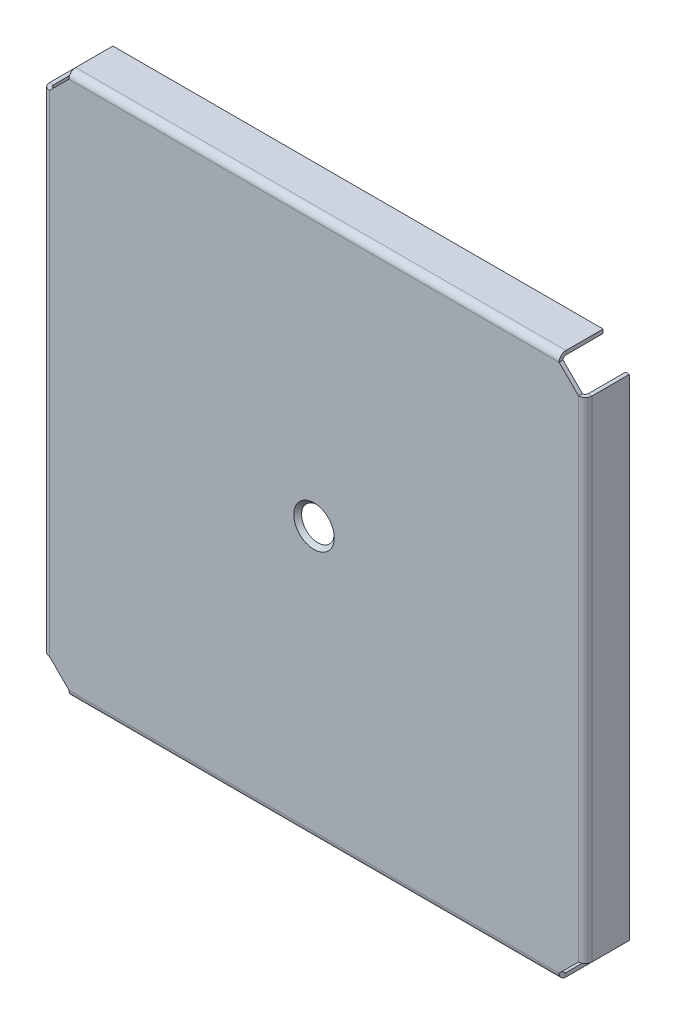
ISO-10303-21;
HEADER;
FILE_DESCRIPTION(('STEP AP214'),'2;1');
FILE_NAME('part.step','',(''),(''),'','','');
FILE_SCHEMA(('AUTOMOTIVE_DESIGN { 1 0 10303 214 1 1 1 1 }'));
ENDSEC;
DATA;
#1=APPLICATION_CONTEXT('core data for automotive mechanical design processes');
#2=APPLICATION_PROTOCOL_DEFINITION('international standard','automotive_design',2000,#1);
#3=PRODUCT_CONTEXT('',#1,'mechanical');
#4=PRODUCT('Part','Part','',(#3));
#5=PRODUCT_RELATED_PRODUCT_CATEGORY('part','',(#4));
#6=PRODUCT_DEFINITION_FORMATION('','',#4);
#7=PRODUCT_DEFINITION_CONTEXT('part definition',#1,'design');
#8=PRODUCT_DEFINITION('design','',#6,#7);
#9=PRODUCT_DEFINITION_SHAPE('','',#8);
#10=(LENGTH_UNIT() NAMED_UNIT(*) SI_UNIT(.MILLI.,.METRE.));
#11=(NAMED_UNIT(*) PLANE_ANGLE_UNIT() SI_UNIT($,.RADIAN.));
#12=(NAMED_UNIT(*) SI_UNIT($,.STERADIAN.) SOLID_ANGLE_UNIT());
#13=UNCERTAINTY_MEASURE_WITH_UNIT(LENGTH_MEASURE(1.E-05),#10,'distance_accuracy_value','');
#14=(GEOMETRIC_REPRESENTATION_CONTEXT(3) GLOBAL_UNCERTAINTY_ASSIGNED_CONTEXT((#13)) GLOBAL_UNIT_ASSIGNED_CONTEXT((#10,
#11,#12)) REPRESENTATION_CONTEXT('',''));
#15=CARTESIAN_POINT('',(0.,0.,0.));
#16=DIRECTION('',(0.,0.,1.));
#17=DIRECTION('',(1.,0.,0.));
#18=AXIS2_PLACEMENT_3D('',#15,#16,#17);
#19=CARTESIAN_POINT('',(-57.5362417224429,104.877514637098,-1.));
#20=DIRECTION('',(-0.707106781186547,0.707106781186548,0.));
#21=DIRECTION('',(-0.707106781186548,-0.707106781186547,0.));
#22=AXIS2_PLACEMENT_3D('',#19,#20,#21);
#23=PLANE('',#22);
#24=DIRECTION('',(-0.707106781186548,-0.707106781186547,0.));
#25=VECTOR('',#24,1.);
#26=CARTESIAN_POINT('',(-57.5362417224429,104.877514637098,0.));
#27=LINE('',#26,#25);
#28=CARTESIAN_POINT('',(-57.5362417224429,104.877514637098,0.));
#29=VERTEX_POINT('',#28);
#30=CARTESIAN_POINT('',(-62.5362417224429,99.8775146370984,0.));
#31=VERTEX_POINT('',#30);
#32=EDGE_CURVE('E515',#29,#31,#27,.T.);
#33=ORIENTED_EDGE('',*,*,#32,.F.);
#34=DIRECTION('',(0.,0.,1.));
#35=VECTOR('',#34,1.);
#36=CARTESIAN_POINT('',(-57.5362417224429,104.877514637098,-1.));
#37=LINE('',#36,#35);
#38=CARTESIAN_POINT('',(-57.5362417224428,104.877514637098,-1.));
#39=VERTEX_POINT('',#38);
#40=EDGE_CURVE('E133',#39,#29,#37,.T.);
#41=ORIENTED_EDGE('',*,*,#40,.F.);
#42=DIRECTION('',(-0.707106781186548,-0.707106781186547,0.));
#43=VECTOR('',#42,1.);
#44=CARTESIAN_POINT('',(-57.5362417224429,104.877514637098,-1.));
#45=LINE('',#44,#43);
#46=CARTESIAN_POINT('',(-62.5362417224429,99.8775146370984,-1.));
#47=VERTEX_POINT('',#46);
#48=EDGE_CURVE('E527',#39,#47,#45,.T.);
#49=ORIENTED_EDGE('',*,*,#48,.T.);
#50=DIRECTION('',(0.,0.,1.));
#51=VECTOR('',#50,1.);
#52=CARTESIAN_POINT('',(-62.5362417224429,99.8775146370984,-1.));
#53=LINE('',#52,#51);
#54=EDGE_CURVE('E556',#47,#31,#53,.T.);
#55=ORIENTED_EDGE('',*,*,#54,.T.);
#56=EDGE_LOOP('',(#33,#41,#49,#55));
#57=FACE_BOUND('',#56,.T.);
#58=ADVANCED_FACE('F123',(#57),#23,.T.);
#59=CARTESIAN_POINT('',(73.4637582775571,99.8775146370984,-1.));
#60=DIRECTION('',(0.707106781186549,0.707106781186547,0.));
#61=DIRECTION('',(-0.707106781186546,0.707106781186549,0.));
#62=AXIS2_PLACEMENT_3D('',#59,#60,#61);
#63=PLANE('',#62);
#64=DIRECTION('',(-0.707106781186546,0.707106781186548,0.));
#65=VECTOR('',#64,1.);
#66=CARTESIAN_POINT('',(73.4637582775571,99.8775146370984,0.));
#67=LINE('',#66,#65);
#68=CARTESIAN_POINT('',(73.4637582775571,99.8775146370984,0.));
#69=VERTEX_POINT('',#68);
#70=CARTESIAN_POINT('',(68.4637582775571,104.877514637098,0.));
#71=VERTEX_POINT('',#70);
#72=EDGE_CURVE('E580',#69,#71,#67,.T.);
#73=ORIENTED_EDGE('',*,*,#72,.F.);
#74=DIRECTION('',(0.,0.,1.));
#75=VECTOR('',#74,1.);
#76=CARTESIAN_POINT('',(73.4637582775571,99.8775146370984,-1.));
#77=LINE('',#76,#75);
#78=CARTESIAN_POINT('',(73.4637582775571,99.8775146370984,-0.99999999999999));
#79=VERTEX_POINT('',#78);
#80=EDGE_CURVE('E593',#79,#69,#77,.T.);
#81=ORIENTED_EDGE('',*,*,#80,.F.);
#82=DIRECTION('',(-0.707106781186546,0.707106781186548,0.));
#83=VECTOR('',#82,1.);
#84=CARTESIAN_POINT('',(73.4637582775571,99.8775146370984,-1.));
#85=LINE('',#84,#83);
#86=CARTESIAN_POINT('',(68.4637582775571,104.877514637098,-1.));
#87=VERTEX_POINT('',#86);
#88=EDGE_CURVE('E549',#79,#87,#85,.T.);
#89=ORIENTED_EDGE('',*,*,#88,.T.);
#90=DIRECTION('',(0.,0.,1.));
#91=VECTOR('',#90,1.);
#92=CARTESIAN_POINT('',(68.4637582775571,104.877514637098,-1.));
#93=LINE('',#92,#91);
#94=EDGE_CURVE('E589',#87,#71,#93,.T.);
#95=ORIENTED_EDGE('',*,*,#94,.T.);
#96=EDGE_LOOP('',(#73,#81,#89,#95));
#97=FACE_BOUND('',#96,.T.);
#98=ADVANCED_FACE('F629',(#97),#63,.T.);
#99=CARTESIAN_POINT('',(68.4637582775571,-31.1224853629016,-1.));
#100=DIRECTION('',(0.707106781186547,-0.707106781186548,0.));
#101=DIRECTION('',(0.707106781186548,0.707106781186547,0.));
#102=AXIS2_PLACEMENT_3D('',#99,#100,#101);
#103=PLANE('',#102);
#104=DIRECTION('',(0.707106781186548,0.707106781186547,0.));
#105=VECTOR('',#104,1.);
#106=CARTESIAN_POINT('',(68.4637582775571,-31.1224853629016,0.));
#107=LINE('',#106,#105);
#108=CARTESIAN_POINT('',(68.4637582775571,-31.1224853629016,0.));
#109=VERTEX_POINT('',#108);
#110=CARTESIAN_POINT('',(73.4637582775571,-26.1224853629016,0.));
#111=VERTEX_POINT('',#110);
#112=EDGE_CURVE('E572',#109,#111,#107,.T.);
#113=ORIENTED_EDGE('',*,*,#112,.F.);
#114=DIRECTION('',(0.,0.,1.));
#115=VECTOR('',#114,1.);
#116=CARTESIAN_POINT('',(68.4637582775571,-31.1224853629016,-1.));
#117=LINE('',#116,#115);
#118=CARTESIAN_POINT('',(68.4637582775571,-31.1224853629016,-1.00000000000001));
#119=VERTEX_POINT('',#118);
#120=EDGE_CURVE('E600',#119,#109,#117,.T.);
#121=ORIENTED_EDGE('',*,*,#120,.F.);
#122=DIRECTION('',(0.707106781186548,0.707106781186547,0.));
#123=VECTOR('',#122,1.);
#124=CARTESIAN_POINT('',(68.4637582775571,-31.1224853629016,-1.));
#125=LINE('',#124,#123);
#126=CARTESIAN_POINT('',(73.4637582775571,-26.1224853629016,-0.99999999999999));
#127=VERTEX_POINT('',#126);
#128=EDGE_CURVE('E542',#119,#127,#125,.T.);
#129=ORIENTED_EDGE('',*,*,#128,.T.);
#130=DIRECTION('',(0.,0.,1.));
#131=VECTOR('',#130,1.);
#132=CARTESIAN_POINT('',(73.4637582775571,-26.1224853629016,-1.));
#133=LINE('',#132,#131);
#134=EDGE_CURVE('E596',#127,#111,#133,.T.);
#135=ORIENTED_EDGE('',*,*,#134,.T.);
#136=EDGE_LOOP('',(#113,#121,#129,#135));
#137=FACE_BOUND('',#136,.T.);
#138=ADVANCED_FACE('F675',(#137),#103,.T.);
#139=CARTESIAN_POINT('',(-62.5362417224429,-26.1224853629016,-1.));
#140=DIRECTION('',(-0.707106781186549,-0.707106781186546,0.));
#141=DIRECTION('',(0.707106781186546,-0.707106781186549,0.));
#142=AXIS2_PLACEMENT_3D('',#139,#140,#141);
#143=PLANE('',#142);
#144=DIRECTION('',(0.707106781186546,-0.707106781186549,0.));
#145=VECTOR('',#144,1.);
#146=CARTESIAN_POINT('',(-62.5362417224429,-26.1224853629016,0.));
#147=LINE('',#146,#145);
#148=CARTESIAN_POINT('',(-62.5362417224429,-26.1224853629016,0.));
#149=VERTEX_POINT('',#148);
#150=CARTESIAN_POINT('',(-57.5362417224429,-31.1224853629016,0.));
#151=VERTEX_POINT('',#150);
#152=EDGE_CURVE('E564',#149,#151,#147,.T.);
#153=ORIENTED_EDGE('',*,*,#152,.F.);
#154=DIRECTION('',(0.,0.,1.));
#155=VECTOR('',#154,1.);
#156=CARTESIAN_POINT('',(-62.5362417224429,-26.1224853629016,-1.));
#157=LINE('',#156,#155);
#158=CARTESIAN_POINT('',(-62.5362417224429,-26.1224853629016,-1.));
#159=VERTEX_POINT('',#158);
#160=EDGE_CURVE('E608',#159,#149,#157,.T.);
#161=ORIENTED_EDGE('',*,*,#160,.F.);
#162=DIRECTION('',(0.707106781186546,-0.707106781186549,0.));
#163=VECTOR('',#162,1.);
#164=CARTESIAN_POINT('',(-62.5362417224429,-26.1224853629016,-1.));
#165=LINE('',#164,#163);
#166=CARTESIAN_POINT('',(-57.5362417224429,-31.1224853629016,-0.999999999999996));
#167=VERTEX_POINT('',#166);
#168=EDGE_CURVE('E535',#159,#167,#165,.T.);
#169=ORIENTED_EDGE('',*,*,#168,.T.);
#170=DIRECTION('',(0.,0.,1.));
#171=VECTOR('',#170,1.);
#172=CARTESIAN_POINT('',(-57.5362417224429,-31.1224853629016,-1.));
#173=LINE('',#172,#171);
#174=EDGE_CURVE('E604',#167,#151,#173,.T.);
#175=ORIENTED_EDGE('',*,*,#174,.T.);
#176=EDGE_LOOP('',(#153,#161,#169,#175));
#177=FACE_BOUND('',#176,.T.);
#178=ADVANCED_FACE('F678',(#177),#143,.T.);
#179=CARTESIAN_POINT('',(0.,0.,-1.));
#180=DIRECTION('',(0.,0.,1.));
#181=DIRECTION('',(1.,0.,0.));
#182=AXIS2_PLACEMENT_3D('',#179,#180,#181);
#183=PLANE('',#182);
#184=CARTESIAN_POINT('',(5.46375827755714,36.8775146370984,-1.));
#185=DIRECTION('',(0.,0.,-1.));
#186=DIRECTION('',(-1.,0.,0.));
#187=AXIS2_PLACEMENT_3D('',#184,#185,#186);
#188=CIRCLE('',#187,4.2);
#189=CARTESIAN_POINT('',(1.26375827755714,36.8775146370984,-1.));
#190=VERTEX_POINT('',#189);
#191=EDGE_CURVE('E339',#190,#190,#188,.T.);
#192=ORIENTED_EDGE('',*,*,#191,.F.);
#193=EDGE_LOOP('',(#192));
#194=FACE_BOUND('',#193,.T.);
#195=ORIENTED_EDGE('',*,*,#48,.F.);
#196=DIRECTION('',(-1.,0.,0.));
#197=VECTOR('',#196,1.);
#198=CARTESIAN_POINT('',(68.4637582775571,104.877514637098,-1.));
#199=LINE('',#198,#197);
#200=EDGE_CURVE('E553',#87,#39,#199,.T.);
#201=ORIENTED_EDGE('',*,*,#200,.F.);
#202=ORIENTED_EDGE('',*,*,#88,.F.);
#203=DIRECTION('',(0.,1.,0.));
#204=VECTOR('',#203,1.);
#205=CARTESIAN_POINT('',(73.4637582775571,-26.1224853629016,-1.));
#206=LINE('',#205,#204);
#207=EDGE_CURVE('E546',#127,#79,#206,.T.);
#208=ORIENTED_EDGE('',*,*,#207,.F.);
#209=ORIENTED_EDGE('',*,*,#128,.F.);
#210=DIRECTION('',(1.,0.,0.));
#211=VECTOR('',#210,1.);
#212=CARTESIAN_POINT('',(-57.5362417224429,-31.1224853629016,-1.));
#213=LINE('',#212,#211);
#214=EDGE_CURVE('E539',#167,#119,#213,.T.);
#215=ORIENTED_EDGE('',*,*,#214,.F.);
#216=ORIENTED_EDGE('',*,*,#168,.F.);
#217=DIRECTION('',(0.,-1.,0.));
#218=VECTOR('',#217,1.);
#219=CARTESIAN_POINT('',(-62.5362417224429,99.8775146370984,-1.));
#220=LINE('',#219,#218);
#221=EDGE_CURVE('E531',#47,#159,#220,.T.);
#222=ORIENTED_EDGE('',*,*,#221,.F.);
#223=EDGE_LOOP('',(#195,#201,#202,#208,#209,#215,#216,#222));
#224=FACE_BOUND('',#223,.T.);
#225=ADVANCED_FACE('F635',(#194,#224),#183,.F.);
#226=CARTESIAN_POINT('',(0.,0.,0.));
#227=DIRECTION('',(0.,0.,1.));
#228=DIRECTION('',(1.,0.,0.));
#229=AXIS2_PLACEMENT_3D('',#226,#227,#228);
#230=PLANE('',#229);
#231=CARTESIAN_POINT('',(5.46375827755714,36.8775146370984,0.));
#232=DIRECTION('',(0.,0.,1.));
#233=DIRECTION('',(1.,0.,0.));
#234=AXIS2_PLACEMENT_3D('',#231,#232,#233);
#235=CIRCLE('',#234,5.19999999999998);
#236=CARTESIAN_POINT('',(10.6637582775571,36.8775146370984,0.));
#237=VERTEX_POINT('',#236);
#238=EDGE_CURVE('E13',#237,#237,#235,.F.);
#239=ORIENTED_EDGE('',*,*,#238,.T.);
#240=EDGE_LOOP('',(#239));
#241=FACE_BOUND('',#240,.T.);
#242=ORIENTED_EDGE('',*,*,#32,.T.);
#243=DIRECTION('',(0.,-1.,0.));
#244=VECTOR('',#243,1.);
#245=CARTESIAN_POINT('',(-62.5362417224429,99.8775146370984,0.));
#246=LINE('',#245,#244);
#247=EDGE_CURVE('E560',#31,#149,#246,.T.);
#248=ORIENTED_EDGE('',*,*,#247,.T.);
#249=ORIENTED_EDGE('',*,*,#152,.T.);
#250=DIRECTION('',(1.,0.,0.));
#251=VECTOR('',#250,1.);
#252=CARTESIAN_POINT('',(-57.5362417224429,-31.1224853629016,0.));
#253=LINE('',#252,#251);
#254=EDGE_CURVE('E568',#151,#109,#253,.T.);
#255=ORIENTED_EDGE('',*,*,#254,.T.);
#256=ORIENTED_EDGE('',*,*,#112,.T.);
#257=DIRECTION('',(0.,1.,0.));
#258=VECTOR('',#257,1.);
#259=CARTESIAN_POINT('',(73.4637582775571,-26.1224853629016,0.));
#260=LINE('',#259,#258);
#261=EDGE_CURVE('E576',#111,#69,#260,.T.);
#262=ORIENTED_EDGE('',*,*,#261,.T.);
#263=ORIENTED_EDGE('',*,*,#72,.T.);
#264=DIRECTION('',(-1.,0.,0.));
#265=VECTOR('',#264,1.);
#266=CARTESIAN_POINT('',(68.4637582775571,104.877514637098,0.));
#267=LINE('',#266,#265);
#268=EDGE_CURVE('E532',#71,#29,#267,.T.);
#269=ORIENTED_EDGE('',*,*,#268,.T.);
#270=EDGE_LOOP('',(#242,#248,#249,#255,#256,#262,#263,#269));
#271=FACE_BOUND('',#270,.T.);
#272=ADVANCED_FACE('F620',(#241,#271),#230,.T.);
#273=CARTESIAN_POINT('',(-57.5362417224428,104.877514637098,-1.73999999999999));
#274=DIRECTION('',(-1.,0.,0.));
#275=DIRECTION('',(0.,0.,1.));
#276=AXIS2_PLACEMENT_3D('',#273,#274,#275);
#277=PLANE('',#276);
#278=DIRECTION('',(0.,-1.,0.));
#279=VECTOR('',#278,1.);
#280=CARTESIAN_POINT('',(-57.5362417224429,106.617514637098,-1.73999999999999));
#281=LINE('',#280,#279);
#282=CARTESIAN_POINT('',(-57.5362417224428,105.617514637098,-1.73999999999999));
#283=VERTEX_POINT('',#282);
#284=CARTESIAN_POINT('',(-57.5362417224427,106.617514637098,-1.73999999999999));
#285=VERTEX_POINT('',#284);
#286=EDGE_CURVE('E459',#283,#285,#281,.F.);
#287=ORIENTED_EDGE('',*,*,#286,.F.);
#288=CARTESIAN_POINT('',(-57.5362417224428,104.877514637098,-1.73999999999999));
#289=DIRECTION('',(1.,0.,0.));
#290=DIRECTION('',(0.,0.,-1.));
#291=AXIS2_PLACEMENT_3D('',#288,#289,#290);
#292=CIRCLE('',#291,0.739999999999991);
#293=EDGE_CURVE('E520',#39,#283,#292,.F.);
#294=ORIENTED_EDGE('',*,*,#293,.F.);
#295=ORIENTED_EDGE('',*,*,#40,.T.);
#296=CARTESIAN_POINT('',(-57.5362417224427,104.877514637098,-1.73999999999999));
#297=DIRECTION('',(1.,0.,0.));
#298=DIRECTION('',(0.,0.,-1.));
#299=AXIS2_PLACEMENT_3D('',#296,#297,#298);
#300=CIRCLE('',#299,1.73999999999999);
#301=EDGE_CURVE('E140',#29,#285,#300,.F.);
#302=ORIENTED_EDGE('',*,*,#301,.T.);
#303=EDGE_LOOP('',(#287,#294,#295,#302));
#304=FACE_BOUND('',#303,.T.);
#305=ADVANCED_FACE('F642',(#304),#277,.T.);
#306=CARTESIAN_POINT('',(68.4637582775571,104.877514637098,-1.73999999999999));
#307=DIRECTION('',(-1.,0.,0.));
#308=DIRECTION('',(0.,0.,1.));
#309=AXIS2_PLACEMENT_3D('',#306,#307,#308);
#310=PLANE('',#309);
#311=CARTESIAN_POINT('',(68.4637582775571,104.877514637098,-1.73999999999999));
#312=DIRECTION('',(1.,0.,0.));
#313=DIRECTION('',(0.,0.,-1.));
#314=AXIS2_PLACEMENT_3D('',#311,#312,#313);
#315=CIRCLE('',#314,0.739999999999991);
#316=CARTESIAN_POINT('',(68.4637582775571,105.617514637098,-1.73999999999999));
#317=VERTEX_POINT('',#316);
#318=EDGE_CURVE('E475',#317,#87,#315,.T.);
#319=ORIENTED_EDGE('',*,*,#318,.F.);
#320=DIRECTION('',(0.,-1.,0.));
#321=VECTOR('',#320,1.);
#322=CARTESIAN_POINT('',(68.4637582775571,105.617514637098,-1.73999999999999));
#323=LINE('',#322,#321);
#324=CARTESIAN_POINT('',(68.4637582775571,106.617514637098,-1.73999999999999));
#325=VERTEX_POINT('',#324);
#326=EDGE_CURVE('E503',#317,#325,#323,.F.);
#327=ORIENTED_EDGE('',*,*,#326,.T.);
#328=CARTESIAN_POINT('',(68.4637582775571,104.877514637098,-1.73999999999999));
#329=DIRECTION('',(1.,0.,0.));
#330=DIRECTION('',(0.,0.,-1.));
#331=AXIS2_PLACEMENT_3D('',#328,#329,#330);
#332=CIRCLE('',#331,1.73999999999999);
#333=EDGE_CURVE('E516',#325,#71,#332,.T.);
#334=ORIENTED_EDGE('',*,*,#333,.T.);
#335=ORIENTED_EDGE('',*,*,#94,.F.);
#336=EDGE_LOOP('',(#319,#327,#334,#335));
#337=FACE_BOUND('',#336,.T.);
#338=ADVANCED_FACE('F625',(#337),#310,.F.);
#339=CARTESIAN_POINT('',(68.4637582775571,104.877514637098,-1.73999999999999));
#340=DIRECTION('',(1.,0.,0.));
#341=DIRECTION('',(0.,1.,0.));
#342=AXIS2_PLACEMENT_3D('',#339,#340,#341);
#343=CYLINDRICAL_SURFACE('',#342,1.73999999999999);
#344=ORIENTED_EDGE('',*,*,#268,.F.);
#345=ORIENTED_EDGE('',*,*,#333,.F.);
#346=DIRECTION('',(1.,0.,0.));
#347=VECTOR('',#346,1.);
#348=CARTESIAN_POINT('',(-57.5362417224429,106.617514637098,-1.73999999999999));
#349=LINE('',#348,#347);
#350=EDGE_CURVE('E500',#325,#285,#349,.F.);
#351=ORIENTED_EDGE('',*,*,#350,.T.);
#352=ORIENTED_EDGE('',*,*,#301,.F.);
#353=EDGE_LOOP('',(#344,#345,#351,#352));
#354=FACE_BOUND('',#353,.T.);
#355=ADVANCED_FACE('F622',(#354),#343,.T.);
#356=CARTESIAN_POINT('',(68.4637582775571,104.877514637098,-1.73999999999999));
#357=DIRECTION('',(1.,0.,0.));
#358=DIRECTION('',(0.,1.,0.));
#359=AXIS2_PLACEMENT_3D('',#356,#357,#358);
#360=CYLINDRICAL_SURFACE('',#359,0.739999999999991);
#361=ORIENTED_EDGE('',*,*,#200,.T.);
#362=ORIENTED_EDGE('',*,*,#293,.T.);
#363=DIRECTION('',(1.,0.,0.));
#364=VECTOR('',#363,1.);
#365=CARTESIAN_POINT('',(-57.5362417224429,105.617514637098,-1.73999999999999));
#366=LINE('',#365,#364);
#367=EDGE_CURVE('E507',#283,#317,#366,.T.);
#368=ORIENTED_EDGE('',*,*,#367,.T.);
#369=ORIENTED_EDGE('',*,*,#318,.T.);
#370=EDGE_LOOP('',(#361,#362,#368,#369));
#371=FACE_BOUND('',#370,.T.);
#372=ADVANCED_FACE('F639',(#371),#360,.F.);
#373=CARTESIAN_POINT('',(68.4637582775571,106.617514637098,-11.3));
#374=DIRECTION('',(-1.,0.,0.));
#375=DIRECTION('',(0.,0.,1.));
#376=AXIS2_PLACEMENT_3D('',#373,#374,#375);
#377=PLANE('',#376);
#378=ORIENTED_EDGE('',*,*,#326,.F.);
#379=DIRECTION('',(0.,0.,1.));
#380=VECTOR('',#379,1.);
#381=CARTESIAN_POINT('',(68.4637582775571,105.617514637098,-11.3));
#382=LINE('',#381,#380);
#383=CARTESIAN_POINT('',(68.4637582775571,105.617514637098,-11.3));
#384=VERTEX_POINT('',#383);
#385=EDGE_CURVE('E497',#317,#384,#382,.F.);
#386=ORIENTED_EDGE('',*,*,#385,.T.);
#387=DIRECTION('',(0.,-1.,0.));
#388=VECTOR('',#387,1.);
#389=CARTESIAN_POINT('',(68.4637582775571,106.617514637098,-11.3));
#390=LINE('',#389,#388);
#391=CARTESIAN_POINT('',(68.4637582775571,106.617514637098,-11.3));
#392=VERTEX_POINT('',#391);
#393=EDGE_CURVE('E471',#392,#384,#390,.T.);
#394=ORIENTED_EDGE('',*,*,#393,.F.);
#395=DIRECTION('',(0.,0.,-1.));
#396=VECTOR('',#395,1.);
#397=CARTESIAN_POINT('',(68.4637582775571,106.617514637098,4.27414168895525E-13));
#398=LINE('',#397,#396);
#399=EDGE_CURVE('E487',#325,#392,#398,.T.);
#400=ORIENTED_EDGE('',*,*,#399,.F.);
#401=EDGE_LOOP('',(#378,#386,#394,#400));
#402=FACE_BOUND('',#401,.T.);
#403=ADVANCED_FACE('F660',(#402),#377,.F.);
#404=CARTESIAN_POINT('',(-57.5362417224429,106.617514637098,-0.999999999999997));
#405=DIRECTION('',(1.,0.,0.));
#406=DIRECTION('',(0.,0.,-1.));
#407=AXIS2_PLACEMENT_3D('',#404,#405,#406);
#408=PLANE('',#407);
#409=ORIENTED_EDGE('',*,*,#286,.T.);
#410=DIRECTION('',(0.,0.,1.));
#411=VECTOR('',#410,1.);
#412=CARTESIAN_POINT('',(-57.5362417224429,106.617514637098,4.27414168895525E-13));
#413=LINE('',#412,#411);
#414=CARTESIAN_POINT('',(-57.5362417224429,106.617514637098,-11.3));
#415=VERTEX_POINT('',#414);
#416=EDGE_CURVE('E480',#415,#285,#413,.T.);
#417=ORIENTED_EDGE('',*,*,#416,.F.);
#418=DIRECTION('',(0.,-1.,0.));
#419=VECTOR('',#418,1.);
#420=CARTESIAN_POINT('',(-57.5362417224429,106.617514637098,-11.3));
#421=LINE('',#420,#419);
#422=CARTESIAN_POINT('',(-57.5362417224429,105.617514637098,-11.3));
#423=VERTEX_POINT('',#422);
#424=EDGE_CURVE('E476',#415,#423,#421,.T.);
#425=ORIENTED_EDGE('',*,*,#424,.T.);
#426=DIRECTION('',(0.,0.,-1.));
#427=VECTOR('',#426,1.);
#428=CARTESIAN_POINT('',(-57.5362417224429,105.617514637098,-1.));
#429=LINE('',#428,#427);
#430=EDGE_CURVE('E490',#423,#283,#429,.F.);
#431=ORIENTED_EDGE('',*,*,#430,.T.);
#432=EDGE_LOOP('',(#409,#417,#425,#431));
#433=FACE_BOUND('',#432,.T.);
#434=ADVANCED_FACE('F645',(#433),#408,.F.);
#435=CARTESIAN_POINT('',(0.,106.617514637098,4.27414168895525E-13));
#436=DIRECTION('',(0.,-1.,0.));
#437=DIRECTION('',(0.,0.,-1.));
#438=AXIS2_PLACEMENT_3D('',#435,#436,#437);
#439=PLANE('',#438);
#440=ORIENTED_EDGE('',*,*,#350,.F.);
#441=ORIENTED_EDGE('',*,*,#399,.T.);
#442=DIRECTION('',(-1.,0.,0.));
#443=VECTOR('',#442,1.);
#444=CARTESIAN_POINT('',(0.,106.617514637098,-11.3));
#445=LINE('',#444,#443);
#446=EDGE_CURVE('E484',#392,#415,#445,.T.);
#447=ORIENTED_EDGE('',*,*,#446,.T.);
#448=ORIENTED_EDGE('',*,*,#416,.T.);
#449=EDGE_LOOP('',(#440,#441,#447,#448));
#450=FACE_BOUND('',#449,.T.);
#451=ADVANCED_FACE('F648',(#450),#439,.F.);
#452=CARTESIAN_POINT('',(0.,105.617514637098,4.23922687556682E-13));
#453=DIRECTION('',(0.,-1.,0.));
#454=DIRECTION('',(0.,0.,-1.));
#455=AXIS2_PLACEMENT_3D('',#452,#453,#454);
#456=PLANE('',#455);
#457=ORIENTED_EDGE('',*,*,#385,.F.);
#458=ORIENTED_EDGE('',*,*,#367,.F.);
#459=ORIENTED_EDGE('',*,*,#430,.F.);
#460=DIRECTION('',(1.,0.,0.));
#461=VECTOR('',#460,1.);
#462=CARTESIAN_POINT('',(-57.5362417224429,105.617514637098,-11.3));
#463=LINE('',#462,#461);
#464=EDGE_CURVE('E494',#384,#423,#463,.F.);
#465=ORIENTED_EDGE('',*,*,#464,.F.);
#466=EDGE_LOOP('',(#457,#458,#459,#465));
#467=FACE_BOUND('',#466,.T.);
#468=ADVANCED_FACE('F658',(#467),#456,.T.);
#469=CARTESIAN_POINT('',(-57.5362417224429,106.617514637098,-11.3));
#470=DIRECTION('',(0.,0.,1.));
#471=DIRECTION('',(0.,-1.,0.));
#472=AXIS2_PLACEMENT_3D('',#469,#470,#471);
#473=PLANE('',#472);
#474=ORIENTED_EDGE('',*,*,#464,.T.);
#475=ORIENTED_EDGE('',*,*,#424,.F.);
#476=ORIENTED_EDGE('',*,*,#446,.F.);
#477=ORIENTED_EDGE('',*,*,#393,.T.);
#478=EDGE_LOOP('',(#474,#475,#476,#477));
#479=FACE_BOUND('',#478,.T.);
#480=ADVANCED_FACE('F654',(#479),#473,.F.);
#481=CARTESIAN_POINT('',(-62.5362417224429,-26.1224853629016,-1.73999999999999));
#482=DIRECTION('',(0.,-1.,0.));
#483=DIRECTION('',(0.,0.,-1.));
#484=AXIS2_PLACEMENT_3D('',#481,#482,#483);
#485=PLANE('',#484);
#486=DIRECTION('',(1.,0.,0.));
#487=VECTOR('',#486,1.);
#488=CARTESIAN_POINT('',(-64.2762417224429,-26.1224853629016,-1.73999999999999));
#489=LINE('',#488,#487);
#490=CARTESIAN_POINT('',(-63.2762417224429,-26.1224853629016,-1.73999999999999));
#491=VERTEX_POINT('',#490);
#492=CARTESIAN_POINT('',(-64.2762417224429,-26.1224853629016,-1.73999999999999));
#493=VERTEX_POINT('',#492);
#494=EDGE_CURVE('E401',#491,#493,#489,.F.);
#495=ORIENTED_EDGE('',*,*,#494,.F.);
#496=CARTESIAN_POINT('',(-62.5362417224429,-26.1224853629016,-1.73999999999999));
#497=DIRECTION('',(0.,1.,0.));
#498=DIRECTION('',(0.,0.,1.));
#499=AXIS2_PLACEMENT_3D('',#496,#497,#498);
#500=CIRCLE('',#499,0.739999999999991);
#501=EDGE_CURVE('E464',#159,#491,#500,.F.);
#502=ORIENTED_EDGE('',*,*,#501,.F.);
#503=ORIENTED_EDGE('',*,*,#160,.T.);
#504=CARTESIAN_POINT('',(-62.5362417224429,-26.1224853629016,-1.73999999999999));
#505=DIRECTION('',(0.,1.,0.));
#506=DIRECTION('',(0.,0.,1.));
#507=AXIS2_PLACEMENT_3D('',#504,#505,#506);
#508=CIRCLE('',#507,1.73999999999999);
#509=EDGE_CURVE('E455',#149,#493,#508,.F.);
#510=ORIENTED_EDGE('',*,*,#509,.T.);
#511=EDGE_LOOP('',(#495,#502,#503,#510));
#512=FACE_BOUND('',#511,.T.);
#513=ADVANCED_FACE('F743',(#512),#485,.T.);
#514=CARTESIAN_POINT('',(-62.5362417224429,99.8775146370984,-1.73999999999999));
#515=DIRECTION('',(0.,-1.,0.));
#516=DIRECTION('',(0.,0.,-1.));
#517=AXIS2_PLACEMENT_3D('',#514,#515,#516);
#518=PLANE('',#517);
#519=CARTESIAN_POINT('',(-62.5362417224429,99.8775146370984,-1.73999999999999));
#520=DIRECTION('',(0.,1.,0.));
#521=DIRECTION('',(0.,0.,1.));
#522=AXIS2_PLACEMENT_3D('',#519,#520,#521);
#523=CIRCLE('',#522,0.739999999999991);
#524=CARTESIAN_POINT('',(-63.2762417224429,99.8775146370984,-1.73999999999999));
#525=VERTEX_POINT('',#524);
#526=EDGE_CURVE('E417',#525,#47,#523,.T.);
#527=ORIENTED_EDGE('',*,*,#526,.F.);
#528=DIRECTION('',(1.,0.,0.));
#529=VECTOR('',#528,1.);
#530=CARTESIAN_POINT('',(-63.2762417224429,99.8775146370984,-1.73999999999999));
#531=LINE('',#530,#529);
#532=CARTESIAN_POINT('',(-64.2762417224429,99.8775146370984,-1.73999999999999));
#533=VERTEX_POINT('',#532);
#534=EDGE_CURVE('E445',#525,#533,#531,.F.);
#535=ORIENTED_EDGE('',*,*,#534,.T.);
#536=CARTESIAN_POINT('',(-62.5362417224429,99.8775146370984,-1.73999999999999));
#537=DIRECTION('',(0.,1.,0.));
#538=DIRECTION('',(0.,0.,1.));
#539=AXIS2_PLACEMENT_3D('',#536,#537,#538);
#540=CIRCLE('',#539,1.73999999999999);
#541=EDGE_CURVE('E460',#533,#31,#540,.T.);
#542=ORIENTED_EDGE('',*,*,#541,.T.);
#543=ORIENTED_EDGE('',*,*,#54,.F.);
#544=EDGE_LOOP('',(#527,#535,#542,#543));
#545=FACE_BOUND('',#544,.T.);
#546=ADVANCED_FACE('F752',(#545),#518,.F.);
#547=CARTESIAN_POINT('',(-62.5362417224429,99.8775146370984,-1.73999999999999));
#548=DIRECTION('',(0.,1.,0.));
#549=DIRECTION('',(-1.,0.,0.));
#550=AXIS2_PLACEMENT_3D('',#547,#548,#549);
#551=CYLINDRICAL_SURFACE('',#550,1.73999999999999);
#552=ORIENTED_EDGE('',*,*,#247,.F.);
#553=ORIENTED_EDGE('',*,*,#541,.F.);
#554=DIRECTION('',(0.,1.,0.));
#555=VECTOR('',#554,1.);
#556=CARTESIAN_POINT('',(-64.2762417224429,-26.1224853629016,-1.73999999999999));
#557=LINE('',#556,#555);
#558=EDGE_CURVE('E442',#533,#493,#557,.F.);
#559=ORIENTED_EDGE('',*,*,#558,.T.);
#560=ORIENTED_EDGE('',*,*,#509,.F.);
#561=EDGE_LOOP('',(#552,#553,#559,#560));
#562=FACE_BOUND('',#561,.T.);
#563=ADVANCED_FACE('F763',(#562),#551,.T.);
#564=CARTESIAN_POINT('',(-62.5362417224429,99.8775146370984,-1.73999999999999));
#565=DIRECTION('',(0.,1.,0.));
#566=DIRECTION('',(-1.,0.,0.));
#567=AXIS2_PLACEMENT_3D('',#564,#565,#566);
#568=CYLINDRICAL_SURFACE('',#567,0.739999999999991);
#569=ORIENTED_EDGE('',*,*,#221,.T.);
#570=ORIENTED_EDGE('',*,*,#501,.T.);
#571=DIRECTION('',(0.,1.,0.));
#572=VECTOR('',#571,1.);
#573=CARTESIAN_POINT('',(-63.2762417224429,-26.1224853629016,-1.73999999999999));
#574=LINE('',#573,#572);
#575=EDGE_CURVE('E449',#491,#525,#574,.T.);
#576=ORIENTED_EDGE('',*,*,#575,.T.);
#577=ORIENTED_EDGE('',*,*,#526,.T.);
#578=EDGE_LOOP('',(#569,#570,#576,#577));
#579=FACE_BOUND('',#578,.T.);
#580=ADVANCED_FACE('F773',(#579),#568,.F.);
#581=CARTESIAN_POINT('',(-64.2762417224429,99.8775146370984,-11.3));
#582=DIRECTION('',(0.,-1.,0.));
#583=DIRECTION('',(0.,0.,-1.));
#584=AXIS2_PLACEMENT_3D('',#581,#582,#583);
#585=PLANE('',#584);
#586=ORIENTED_EDGE('',*,*,#534,.F.);
#587=DIRECTION('',(0.,0.,1.));
#588=VECTOR('',#587,1.);
#589=CARTESIAN_POINT('',(-63.2762417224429,99.8775146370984,-11.3));
#590=LINE('',#589,#588);
#591=CARTESIAN_POINT('',(-63.2762417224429,99.8775146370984,-11.3));
#592=VERTEX_POINT('',#591);
#593=EDGE_CURVE('E439',#525,#592,#590,.F.);
#594=ORIENTED_EDGE('',*,*,#593,.T.);
#595=DIRECTION('',(1.,0.,0.));
#596=VECTOR('',#595,1.);
#597=CARTESIAN_POINT('',(-64.2762417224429,99.8775146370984,-11.3));
#598=LINE('',#597,#596);
#599=CARTESIAN_POINT('',(-64.2762417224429,99.8775146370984,-11.3));
#600=VERTEX_POINT('',#599);
#601=EDGE_CURVE('E413',#600,#592,#598,.T.);
#602=ORIENTED_EDGE('',*,*,#601,.F.);
#603=DIRECTION('',(0.,0.,-1.));
#604=VECTOR('',#603,1.);
#605=CARTESIAN_POINT('',(-64.2762417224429,99.8775146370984,2.56267605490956E-13));
#606=LINE('',#605,#604);
#607=EDGE_CURVE('E429',#533,#600,#606,.T.);
#608=ORIENTED_EDGE('',*,*,#607,.F.);
#609=EDGE_LOOP('',(#586,#594,#602,#608));
#610=FACE_BOUND('',#609,.T.);
#611=ADVANCED_FACE('F784',(#610),#585,.F.);
#612=CARTESIAN_POINT('',(-64.2762417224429,-26.1224853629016,-0.999999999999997));
#613=DIRECTION('',(0.,1.,0.));
#614=DIRECTION('',(0.,0.,1.));
#615=AXIS2_PLACEMENT_3D('',#612,#613,#614);
#616=PLANE('',#615);
#617=ORIENTED_EDGE('',*,*,#494,.T.);
#618=DIRECTION('',(0.,0.,1.));
#619=VECTOR('',#618,1.);
#620=CARTESIAN_POINT('',(-64.2762417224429,-26.1224853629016,2.56267605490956E-13));
#621=LINE('',#620,#619);
#622=CARTESIAN_POINT('',(-64.2762417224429,-26.1224853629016,-11.3));
#623=VERTEX_POINT('',#622);
#624=EDGE_CURVE('E422',#623,#493,#621,.T.);
#625=ORIENTED_EDGE('',*,*,#624,.F.);
#626=DIRECTION('',(1.,0.,0.));
#627=VECTOR('',#626,1.);
#628=CARTESIAN_POINT('',(-64.2762417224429,-26.1224853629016,-11.3));
#629=LINE('',#628,#627);
#630=CARTESIAN_POINT('',(-63.2762417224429,-26.1224853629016,-11.3));
#631=VERTEX_POINT('',#630);
#632=EDGE_CURVE('E418',#623,#631,#629,.T.);
#633=ORIENTED_EDGE('',*,*,#632,.T.);
#634=DIRECTION('',(0.,0.,-1.));
#635=VECTOR('',#634,1.);
#636=CARTESIAN_POINT('',(-63.2762417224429,-26.1224853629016,-1.));
#637=LINE('',#636,#635);
#638=EDGE_CURVE('E432',#631,#491,#637,.F.);
#639=ORIENTED_EDGE('',*,*,#638,.T.);
#640=EDGE_LOOP('',(#617,#625,#633,#639));
#641=FACE_BOUND('',#640,.T.);
#642=ADVANCED_FACE('F795',(#641),#616,.F.);
#643=CARTESIAN_POINT('',(-64.2762417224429,0.,2.56267605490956E-13));
#644=DIRECTION('',(1.,0.,0.));
#645=DIRECTION('',(0.,0.,-1.));
#646=AXIS2_PLACEMENT_3D('',#643,#644,#645);
#647=PLANE('',#646);
#648=ORIENTED_EDGE('',*,*,#558,.F.);
#649=ORIENTED_EDGE('',*,*,#607,.T.);
#650=DIRECTION('',(0.,-1.,0.));
#651=VECTOR('',#650,1.);
#652=CARTESIAN_POINT('',(-64.2762417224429,0.,-11.3));
#653=LINE('',#652,#651);
#654=EDGE_CURVE('E426',#600,#623,#653,.T.);
#655=ORIENTED_EDGE('',*,*,#654,.T.);
#656=ORIENTED_EDGE('',*,*,#624,.T.);
#657=EDGE_LOOP('',(#648,#649,#655,#656));
#658=FACE_BOUND('',#657,.T.);
#659=ADVANCED_FACE('F806',(#658),#647,.F.);
#660=CARTESIAN_POINT('',(-63.2762417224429,0.,2.52776124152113E-13));
#661=DIRECTION('',(1.,0.,0.));
#662=DIRECTION('',(0.,0.,-1.));
#663=AXIS2_PLACEMENT_3D('',#660,#661,#662);
#664=PLANE('',#663);
#665=ORIENTED_EDGE('',*,*,#593,.F.);
#666=ORIENTED_EDGE('',*,*,#575,.F.);
#667=ORIENTED_EDGE('',*,*,#638,.F.);
#668=DIRECTION('',(0.,1.,0.));
#669=VECTOR('',#668,1.);
#670=CARTESIAN_POINT('',(-63.2762417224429,-26.1224853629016,-11.3));
#671=LINE('',#670,#669);
#672=EDGE_CURVE('E436',#592,#631,#671,.F.);
#673=ORIENTED_EDGE('',*,*,#672,.F.);
#674=EDGE_LOOP('',(#665,#666,#667,#673));
#675=FACE_BOUND('',#674,.T.);
#676=ADVANCED_FACE('F817',(#675),#664,.T.);
#677=CARTESIAN_POINT('',(-64.2762417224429,-26.1224853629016,-11.3));
#678=DIRECTION('',(0.,0.,1.));
#679=DIRECTION('',(1.,0.,0.));
#680=AXIS2_PLACEMENT_3D('',#677,#678,#679);
#681=PLANE('',#680);
#682=ORIENTED_EDGE('',*,*,#672,.T.);
#683=ORIENTED_EDGE('',*,*,#632,.F.);
#684=ORIENTED_EDGE('',*,*,#654,.F.);
#685=ORIENTED_EDGE('',*,*,#601,.T.);
#686=EDGE_LOOP('',(#682,#683,#684,#685));
#687=FACE_BOUND('',#686,.T.);
#688=ADVANCED_FACE('F828',(#687),#681,.F.);
#689=CARTESIAN_POINT('',(68.4637582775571,-31.1224853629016,-1.74000000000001));
#690=DIRECTION('',(1.,0.,0.));
#691=DIRECTION('',(0.,0.,-1.));
#692=AXIS2_PLACEMENT_3D('',#689,#690,#691);
#693=PLANE('',#692);
#694=DIRECTION('',(0.,1.,0.));
#695=VECTOR('',#694,1.);
#696=CARTESIAN_POINT('',(68.4637582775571,-32.8624853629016,-1.73999999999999));
#697=LINE('',#696,#695);
#698=CARTESIAN_POINT('',(68.4637582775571,-31.8624853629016,-1.74));
#699=VERTEX_POINT('',#698);
#700=CARTESIAN_POINT('',(68.4637582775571,-32.8624853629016,-1.74));
#701=VERTEX_POINT('',#700);
#702=EDGE_CURVE('E342',#699,#701,#697,.F.);
#703=ORIENTED_EDGE('',*,*,#702,.F.);
#704=CARTESIAN_POINT('',(68.4637582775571,-31.1224853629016,-1.74000000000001));
#705=DIRECTION('',(-1.,0.,0.));
#706=DIRECTION('',(0.,0.,1.));
#707=AXIS2_PLACEMENT_3D('',#704,#705,#706);
#708=CIRCLE('',#707,0.739999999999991);
#709=EDGE_CURVE('E406',#119,#699,#708,.F.);
#710=ORIENTED_EDGE('',*,*,#709,.F.);
#711=ORIENTED_EDGE('',*,*,#120,.T.);
#712=CARTESIAN_POINT('',(68.4637582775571,-31.1224853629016,-1.74000000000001));
#713=DIRECTION('',(-1.,0.,0.));
#714=DIRECTION('',(0.,0.,1.));
#715=AXIS2_PLACEMENT_3D('',#712,#713,#714);
#716=CIRCLE('',#715,1.73999999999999);
#717=EDGE_CURVE('E397',#109,#701,#716,.F.);
#718=ORIENTED_EDGE('',*,*,#717,.T.);
#719=EDGE_LOOP('',(#703,#710,#711,#718));
#720=FACE_BOUND('',#719,.T.);
#721=ADVANCED_FACE('F839',(#720),#693,.T.);
#722=CARTESIAN_POINT('',(-57.5362417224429,-31.1224853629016,-1.73999999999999));
#723=DIRECTION('',(1.,0.,0.));
#724=DIRECTION('',(0.,0.,-1.));
#725=AXIS2_PLACEMENT_3D('',#722,#723,#724);
#726=PLANE('',#725);
#727=CARTESIAN_POINT('',(-57.5362417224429,-31.1224853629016,-1.73999999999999));
#728=DIRECTION('',(-1.,0.,0.));
#729=DIRECTION('',(0.,0.,1.));
#730=AXIS2_PLACEMENT_3D('',#727,#728,#729);
#731=CIRCLE('',#730,0.739999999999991);
#732=CARTESIAN_POINT('',(-57.5362417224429,-31.8624853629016,-1.73999999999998));
#733=VERTEX_POINT('',#732);
#734=EDGE_CURVE('E359',#733,#167,#731,.T.);
#735=ORIENTED_EDGE('',*,*,#734,.F.);
#736=DIRECTION('',(0.,1.,0.));
#737=VECTOR('',#736,1.);
#738=CARTESIAN_POINT('',(-57.5362417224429,-31.8624853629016,-1.73999999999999));
#739=LINE('',#738,#737);
#740=CARTESIAN_POINT('',(-57.5362417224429,-32.8624853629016,-1.73999999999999));
#741=VERTEX_POINT('',#740);
#742=EDGE_CURVE('E387',#733,#741,#739,.F.);
#743=ORIENTED_EDGE('',*,*,#742,.T.);
#744=CARTESIAN_POINT('',(-57.5362417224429,-31.1224853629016,-1.73999999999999));
#745=DIRECTION('',(-1.,0.,0.));
#746=DIRECTION('',(0.,0.,1.));
#747=AXIS2_PLACEMENT_3D('',#744,#745,#746);
#748=CIRCLE('',#747,1.73999999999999);
#749=EDGE_CURVE('E402',#741,#151,#748,.T.);
#750=ORIENTED_EDGE('',*,*,#749,.T.);
#751=ORIENTED_EDGE('',*,*,#174,.F.);
#752=EDGE_LOOP('',(#735,#743,#750,#751));
#753=FACE_BOUND('',#752,.T.);
#754=ADVANCED_FACE('F850',(#753),#726,.F.);
#755=CARTESIAN_POINT('',(-57.5362417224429,-31.1224853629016,-1.73999999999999));
#756=DIRECTION('',(-1.,0.,0.));
#757=DIRECTION('',(0.,-1.,0.));
#758=AXIS2_PLACEMENT_3D('',#755,#756,#757);
#759=CYLINDRICAL_SURFACE('',#758,1.73999999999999);
#760=ORIENTED_EDGE('',*,*,#254,.F.);
#761=ORIENTED_EDGE('',*,*,#749,.F.);
#762=DIRECTION('',(-1.,0.,0.));
#763=VECTOR('',#762,1.);
#764=CARTESIAN_POINT('',(68.4637582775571,-32.8624853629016,-1.73999999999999));
#765=LINE('',#764,#763);
#766=EDGE_CURVE('E384',#741,#701,#765,.F.);
#767=ORIENTED_EDGE('',*,*,#766,.T.);
#768=ORIENTED_EDGE('',*,*,#717,.F.);
#769=EDGE_LOOP('',(#760,#761,#767,#768));
#770=FACE_BOUND('',#769,.T.);
#771=ADVANCED_FACE('F861',(#770),#759,.T.);
#772=CARTESIAN_POINT('',(-57.5362417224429,-31.1224853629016,-1.73999999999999));
#773=DIRECTION('',(-1.,0.,0.));
#774=DIRECTION('',(0.,-1.,0.));
#775=AXIS2_PLACEMENT_3D('',#772,#773,#774);
#776=CYLINDRICAL_SURFACE('',#775,0.739999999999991);
#777=ORIENTED_EDGE('',*,*,#214,.T.);
#778=ORIENTED_EDGE('',*,*,#709,.T.);
#779=DIRECTION('',(-1.,0.,0.));
#780=VECTOR('',#779,1.);
#781=CARTESIAN_POINT('',(68.4637582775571,-31.8624853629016,-1.74));
#782=LINE('',#781,#780);
#783=EDGE_CURVE('E391',#699,#733,#782,.T.);
#784=ORIENTED_EDGE('',*,*,#783,.T.);
#785=ORIENTED_EDGE('',*,*,#734,.T.);
#786=EDGE_LOOP('',(#777,#778,#784,#785));
#787=FACE_BOUND('',#786,.T.);
#788=ADVANCED_FACE('F872',(#787),#776,.F.);
#789=CARTESIAN_POINT('',(-57.5362417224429,-32.8624853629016,-11.3));
#790=DIRECTION('',(1.,0.,0.));
#791=DIRECTION('',(0.,0.,-1.));
#792=AXIS2_PLACEMENT_3D('',#789,#790,#791);
#793=PLANE('',#792);
#794=ORIENTED_EDGE('',*,*,#742,.F.);
#795=DIRECTION('',(0.,0.,1.));
#796=VECTOR('',#795,1.);
#797=CARTESIAN_POINT('',(-57.5362417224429,-31.8624853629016,-11.3));
#798=LINE('',#797,#796);
#799=CARTESIAN_POINT('',(-57.5362417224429,-31.8624853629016,-11.3));
#800=VERTEX_POINT('',#799);
#801=EDGE_CURVE('E381',#733,#800,#798,.F.);
#802=ORIENTED_EDGE('',*,*,#801,.T.);
#803=DIRECTION('',(0.,1.,0.));
#804=VECTOR('',#803,1.);
#805=CARTESIAN_POINT('',(-57.5362417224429,-32.8624853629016,-11.3));
#806=LINE('',#805,#804);
#807=CARTESIAN_POINT('',(-57.5362417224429,-32.8624853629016,-11.3));
#808=VERTEX_POINT('',#807);
#809=EDGE_CURVE('E355',#808,#800,#806,.T.);
#810=ORIENTED_EDGE('',*,*,#809,.F.);
#811=DIRECTION('',(0.,0.,-1.));
#812=VECTOR('',#811,1.);
#813=CARTESIAN_POINT('',(-57.5362417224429,-32.8624853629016,1.08324308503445E-13));
#814=LINE('',#813,#812);
#815=EDGE_CURVE('E371',#741,#808,#814,.T.);
#816=ORIENTED_EDGE('',*,*,#815,.F.);
#817=EDGE_LOOP('',(#794,#802,#810,#816));
#818=FACE_BOUND('',#817,.T.);
#819=ADVANCED_FACE('F883',(#818),#793,.F.);
#820=CARTESIAN_POINT('',(68.4637582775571,-32.8624853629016,-0.999999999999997));
#821=DIRECTION('',(-1.,0.,0.));
#822=DIRECTION('',(0.,0.,1.));
#823=AXIS2_PLACEMENT_3D('',#820,#821,#822);
#824=PLANE('',#823);
#825=ORIENTED_EDGE('',*,*,#702,.T.);
#826=DIRECTION('',(0.,0.,1.));
#827=VECTOR('',#826,1.);
#828=CARTESIAN_POINT('',(68.4637582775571,-32.8624853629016,1.08324308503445E-13));
#829=LINE('',#828,#827);
#830=CARTESIAN_POINT('',(68.4637582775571,-32.8624853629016,-11.3));
#831=VERTEX_POINT('',#830);
#832=EDGE_CURVE('E364',#831,#701,#829,.T.);
#833=ORIENTED_EDGE('',*,*,#832,.F.);
#834=DIRECTION('',(0.,1.,0.));
#835=VECTOR('',#834,1.);
#836=CARTESIAN_POINT('',(68.4637582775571,-32.8624853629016,-11.3));
#837=LINE('',#836,#835);
#838=CARTESIAN_POINT('',(68.4637582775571,-31.8624853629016,-11.3));
#839=VERTEX_POINT('',#838);
#840=EDGE_CURVE('E360',#831,#839,#837,.T.);
#841=ORIENTED_EDGE('',*,*,#840,.T.);
#842=DIRECTION('',(0.,0.,-1.));
#843=VECTOR('',#842,1.);
#844=CARTESIAN_POINT('',(68.4637582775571,-31.8624853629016,-1.));
#845=LINE('',#844,#843);
#846=EDGE_CURVE('E374',#839,#699,#845,.F.);
#847=ORIENTED_EDGE('',*,*,#846,.T.);
#848=EDGE_LOOP('',(#825,#833,#841,#847));
#849=FACE_BOUND('',#848,.T.);
#850=ADVANCED_FACE('F894',(#849),#824,.F.);
#851=CARTESIAN_POINT('',(0.,-32.8624853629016,1.08324308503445E-13));
#852=DIRECTION('',(0.,1.,0.));
#853=DIRECTION('',(0.,0.,1.));
#854=AXIS2_PLACEMENT_3D('',#851,#852,#853);
#855=PLANE('',#854);
#856=ORIENTED_EDGE('',*,*,#766,.F.);
#857=ORIENTED_EDGE('',*,*,#815,.T.);
#858=DIRECTION('',(1.,0.,0.));
#859=VECTOR('',#858,1.);
#860=CARTESIAN_POINT('',(0.,-32.8624853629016,-11.3));
#861=LINE('',#860,#859);
#862=EDGE_CURVE('E368',#808,#831,#861,.T.);
#863=ORIENTED_EDGE('',*,*,#862,.T.);
#864=ORIENTED_EDGE('',*,*,#832,.T.);
#865=EDGE_LOOP('',(#856,#857,#863,#864));
#866=FACE_BOUND('',#865,.T.);
#867=ADVANCED_FACE('F905',(#866),#855,.F.);
#868=CARTESIAN_POINT('',(0.,-31.8624853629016,1.04832827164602E-13));
#869=DIRECTION('',(0.,1.,0.));
#870=DIRECTION('',(0.,0.,1.));
#871=AXIS2_PLACEMENT_3D('',#868,#869,#870);
#872=PLANE('',#871);
#873=ORIENTED_EDGE('',*,*,#801,.F.);
#874=ORIENTED_EDGE('',*,*,#783,.F.);
#875=ORIENTED_EDGE('',*,*,#846,.F.);
#876=DIRECTION('',(-1.,0.,0.));
#877=VECTOR('',#876,1.);
#878=CARTESIAN_POINT('',(68.4637582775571,-31.8624853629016,-11.3));
#879=LINE('',#878,#877);
#880=EDGE_CURVE('E378',#800,#839,#879,.F.);
#881=ORIENTED_EDGE('',*,*,#880,.F.);
#882=EDGE_LOOP('',(#873,#874,#875,#881));
#883=FACE_BOUND('',#882,.T.);
#884=ADVANCED_FACE('F916',(#883),#872,.T.);
#885=CARTESIAN_POINT('',(68.4637582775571,-32.8624853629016,-11.3));
#886=DIRECTION('',(0.,0.,1.));
#887=DIRECTION('',(0.,-1.,0.));
#888=AXIS2_PLACEMENT_3D('',#885,#886,#887);
#889=PLANE('',#888);
#890=ORIENTED_EDGE('',*,*,#880,.T.);
#891=ORIENTED_EDGE('',*,*,#840,.F.);
#892=ORIENTED_EDGE('',*,*,#862,.F.);
#893=ORIENTED_EDGE('',*,*,#809,.T.);
#894=EDGE_LOOP('',(#890,#891,#892,#893));
#895=FACE_BOUND('',#894,.T.);
#896=ADVANCED_FACE('F927',(#895),#889,.F.);
#897=CARTESIAN_POINT('',(73.4637582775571,99.8775146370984,-1.73999999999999));
#898=DIRECTION('',(0.,1.,0.));
#899=DIRECTION('',(0.,0.,1.));
#900=AXIS2_PLACEMENT_3D('',#897,#898,#899);
#901=PLANE('',#900);
#902=DIRECTION('',(-1.,0.,0.));
#903=VECTOR('',#902,1.);
#904=CARTESIAN_POINT('',(75.2037582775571,99.8775146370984,-1.73999999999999));
#905=LINE('',#904,#903);
#906=CARTESIAN_POINT('',(74.2037582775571,99.8775146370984,-1.73999999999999));
#907=VERTEX_POINT('',#906);
#908=CARTESIAN_POINT('',(75.2037582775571,99.8775146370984,-1.73999999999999));
#909=VERTEX_POINT('',#908);
#910=EDGE_CURVE('E312',#907,#909,#905,.F.);
#911=ORIENTED_EDGE('',*,*,#910,.F.);
#912=CARTESIAN_POINT('',(73.4637582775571,99.8775146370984,-1.73999999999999));
#913=DIRECTION('',(0.,-1.,0.));
#914=DIRECTION('',(0.,0.,-1.));
#915=AXIS2_PLACEMENT_3D('',#912,#913,#914);
#916=CIRCLE('',#915,0.740000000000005);
#917=EDGE_CURVE('E347',#79,#907,#916,.F.);
#918=ORIENTED_EDGE('',*,*,#917,.F.);
#919=ORIENTED_EDGE('',*,*,#80,.T.);
#920=CARTESIAN_POINT('',(73.4637582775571,99.8775146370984,-1.73999999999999));
#921=DIRECTION('',(0.,-1.,0.));
#922=DIRECTION('',(0.,0.,-1.));
#923=AXIS2_PLACEMENT_3D('',#920,#921,#922);
#924=CIRCLE('',#923,1.74);
#925=EDGE_CURVE('E148',#69,#909,#924,.F.);
#926=ORIENTED_EDGE('',*,*,#925,.T.);
#927=EDGE_LOOP('',(#911,#918,#919,#926));
#928=FACE_BOUND('',#927,.T.);
#929=ADVANCED_FACE('F938',(#928),#901,.T.);
#930=CARTESIAN_POINT('',(73.4637582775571,-26.1224853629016,-1.73999999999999));
#931=DIRECTION('',(0.,1.,0.));
#932=DIRECTION('',(0.,0.,1.));
#933=AXIS2_PLACEMENT_3D('',#930,#931,#932);
#934=PLANE('',#933);
#935=CARTESIAN_POINT('',(73.4637582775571,-26.1224853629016,-1.73999999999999));
#936=DIRECTION('',(0.,-1.,0.));
#937=DIRECTION('',(0.,0.,-1.));
#938=AXIS2_PLACEMENT_3D('',#935,#936,#937);
#939=CIRCLE('',#938,0.740000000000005);
#940=CARTESIAN_POINT('',(74.2037582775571,-26.1224853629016,-1.73999999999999));
#941=VERTEX_POINT('',#940);
#942=EDGE_CURVE('E351',#941,#127,#939,.T.);
#943=ORIENTED_EDGE('',*,*,#942,.F.);
#944=DIRECTION('',(-1.,0.,0.));
#945=VECTOR('',#944,1.);
#946=CARTESIAN_POINT('',(74.2037582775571,-26.1224853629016,-1.73999999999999));
#947=LINE('',#946,#945);
#948=CARTESIAN_POINT('',(75.2037582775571,-26.1224853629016,-1.73999999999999));
#949=VERTEX_POINT('',#948);
#950=EDGE_CURVE('E330',#941,#949,#947,.F.);
#951=ORIENTED_EDGE('',*,*,#950,.T.);
#952=CARTESIAN_POINT('',(73.4637582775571,-26.1224853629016,-1.73999999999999));
#953=DIRECTION('',(0.,-1.,0.));
#954=DIRECTION('',(0.,0.,-1.));
#955=AXIS2_PLACEMENT_3D('',#952,#953,#954);
#956=CIRCLE('',#955,1.74);
#957=EDGE_CURVE('E343',#949,#111,#956,.T.);
#958=ORIENTED_EDGE('',*,*,#957,.T.);
#959=ORIENTED_EDGE('',*,*,#134,.F.);
#960=EDGE_LOOP('',(#943,#951,#958,#959));
#961=FACE_BOUND('',#960,.T.);
#962=ADVANCED_FACE('F949',(#961),#934,.F.);
#963=CARTESIAN_POINT('',(73.4637582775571,-26.1224853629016,-1.73999999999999));
#964=DIRECTION('',(0.,-1.,0.));
#965=DIRECTION('',(1.,0.,0.));
#966=AXIS2_PLACEMENT_3D('',#963,#964,#965);
#967=CYLINDRICAL_SURFACE('',#966,1.74);
#968=ORIENTED_EDGE('',*,*,#261,.F.);
#969=ORIENTED_EDGE('',*,*,#957,.F.);
#970=DIRECTION('',(0.,-1.,0.));
#971=VECTOR('',#970,1.);
#972=CARTESIAN_POINT('',(75.2037582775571,99.8775146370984,-1.73999999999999));
#973=LINE('',#972,#971);
#974=EDGE_CURVE('E327',#949,#909,#973,.F.);
#975=ORIENTED_EDGE('',*,*,#974,.T.);
#976=ORIENTED_EDGE('',*,*,#925,.F.);
#977=EDGE_LOOP('',(#968,#969,#975,#976));
#978=FACE_BOUND('',#977,.T.);
#979=ADVANCED_FACE('F960',(#978),#967,.T.);
#980=CARTESIAN_POINT('',(73.4637582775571,-26.1224853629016,-1.73999999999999));
#981=DIRECTION('',(0.,-1.,0.));
#982=DIRECTION('',(1.,0.,0.));
#983=AXIS2_PLACEMENT_3D('',#980,#981,#982);
#984=CYLINDRICAL_SURFACE('',#983,0.740000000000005);
#985=ORIENTED_EDGE('',*,*,#207,.T.);
#986=ORIENTED_EDGE('',*,*,#917,.T.);
#987=DIRECTION('',(0.,-1.,0.));
#988=VECTOR('',#987,1.);
#989=CARTESIAN_POINT('',(74.2037582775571,99.8775146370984,-1.73999999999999));
#990=LINE('',#989,#988);
#991=EDGE_CURVE('E334',#907,#941,#990,.T.);
#992=ORIENTED_EDGE('',*,*,#991,.T.);
#993=ORIENTED_EDGE('',*,*,#942,.T.);
#994=EDGE_LOOP('',(#985,#986,#992,#993));
#995=FACE_BOUND('',#994,.T.);
#996=ADVANCED_FACE('F971',(#995),#984,.F.);
#997=CARTESIAN_POINT('',(75.2037582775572,-26.1224853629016,-11.3));
#998=DIRECTION('',(0.,1.,0.));
#999=DIRECTION('',(0.,0.,1.));
#1000=AXIS2_PLACEMENT_3D('',#997,#998,#999);
#1001=PLANE('',#1000);
#1002=ORIENTED_EDGE('',*,*,#950,.F.);
#1003=DIRECTION('',(0.,0.,1.));
#1004=VECTOR('',#1003,1.);
#1005=CARTESIAN_POINT('',(74.2037582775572,-26.1224853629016,-11.3));
#1006=LINE('',#1005,#1004);
#1007=CARTESIAN_POINT('',(74.2037582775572,-26.1224853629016,-11.3));
#1008=VERTEX_POINT('',#1007);
#1009=EDGE_CURVE('E324',#941,#1008,#1006,.F.);
#1010=ORIENTED_EDGE('',*,*,#1009,.T.);
#1011=DIRECTION('',(-1.,0.,0.));
#1012=VECTOR('',#1011,1.);
#1013=CARTESIAN_POINT('',(75.2037582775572,-26.1224853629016,-11.3));
#1014=LINE('',#1013,#1012);
#1015=CARTESIAN_POINT('',(75.2037582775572,-26.1224853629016,-11.3));
#1016=VERTEX_POINT('',#1015);
#1017=EDGE_CURVE('E308',#1016,#1008,#1014,.T.);
#1018=ORIENTED_EDGE('',*,*,#1017,.F.);
#1019=DIRECTION('',(0.,0.,-1.));
#1020=VECTOR('',#1019,1.);
#1021=CARTESIAN_POINT('',(75.2037582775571,-26.1224853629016,3.00437437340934E-13));
#1022=LINE('',#1021,#1020);
#1023=EDGE_CURVE('E293',#949,#1016,#1022,.T.);
#1024=ORIENTED_EDGE('',*,*,#1023,.F.);
#1025=EDGE_LOOP('',(#1002,#1010,#1018,#1024));
#1026=FACE_BOUND('',#1025,.T.);
#1027=ADVANCED_FACE('F981',(#1026),#1001,.F.);
#1028=CARTESIAN_POINT('',(75.2037582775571,99.8775146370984,-0.999999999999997));
#1029=DIRECTION('',(0.,-1.,0.));
#1030=DIRECTION('',(0.,0.,-1.));
#1031=AXIS2_PLACEMENT_3D('',#1028,#1029,#1030);
#1032=PLANE('',#1031);
#1033=ORIENTED_EDGE('',*,*,#910,.T.);
#1034=DIRECTION('',(0.,0.,1.));
#1035=VECTOR('',#1034,1.);
#1036=CARTESIAN_POINT('',(75.2037582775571,99.8775146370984,3.00437437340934E-13));
#1037=LINE('',#1036,#1035);
#1038=CARTESIAN_POINT('',(75.2037582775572,99.8775146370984,-11.3));
#1039=VERTEX_POINT('',#1038);
#1040=EDGE_CURVE('E291',#1039,#909,#1037,.T.);
#1041=ORIENTED_EDGE('',*,*,#1040,.F.);
#1042=DIRECTION('',(-1.,0.,0.));
#1043=VECTOR('',#1042,1.);
#1044=CARTESIAN_POINT('',(75.2037582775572,99.8775146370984,-11.3));
#1045=LINE('',#1044,#1043);
#1046=CARTESIAN_POINT('',(74.2037582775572,99.8775146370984,-11.3));
#1047=VERTEX_POINT('',#1046);
#1048=EDGE_CURVE('E300',#1039,#1047,#1045,.T.);
#1049=ORIENTED_EDGE('',*,*,#1048,.T.);
#1050=DIRECTION('',(0.,0.,-1.));
#1051=VECTOR('',#1050,1.);
#1052=CARTESIAN_POINT('',(74.2037582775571,99.8775146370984,-1.));
#1053=LINE('',#1052,#1051);
#1054=EDGE_CURVE('E319',#1047,#907,#1053,.F.);
#1055=ORIENTED_EDGE('',*,*,#1054,.T.);
#1056=EDGE_LOOP('',(#1033,#1041,#1049,#1055));
#1057=FACE_BOUND('',#1056,.T.);
#1058=ADVANCED_FACE('F311',(#1057),#1032,.F.);
#1059=CARTESIAN_POINT('',(75.2037582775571,0.,3.00437437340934E-13));
#1060=DIRECTION('',(-1.,0.,0.));
#1061=DIRECTION('',(0.,0.,1.));
#1062=AXIS2_PLACEMENT_3D('',#1059,#1060,#1061);
#1063=PLANE('',#1062);
#1064=ORIENTED_EDGE('',*,*,#974,.F.);
#1065=ORIENTED_EDGE('',*,*,#1023,.T.);
#1066=DIRECTION('',(0.,1.,0.));
#1067=VECTOR('',#1066,1.);
#1068=CARTESIAN_POINT('',(75.2037582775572,0.,-11.3));
#1069=LINE('',#1068,#1067);
#1070=EDGE_CURVE('E286',#1016,#1039,#1069,.T.);
#1071=ORIENTED_EDGE('',*,*,#1070,.T.);
#1072=ORIENTED_EDGE('',*,*,#1040,.T.);
#1073=EDGE_LOOP('',(#1064,#1065,#1071,#1072));
#1074=FACE_BOUND('',#1073,.T.);
#1075=ADVANCED_FACE('F289',(#1074),#1063,.F.);
#1076=CARTESIAN_POINT('',(74.2037582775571,0.,2.9694595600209E-13));
#1077=DIRECTION('',(-1.,0.,0.));
#1078=DIRECTION('',(0.,0.,1.));
#1079=AXIS2_PLACEMENT_3D('',#1076,#1077,#1078);
#1080=PLANE('',#1079);
#1081=ORIENTED_EDGE('',*,*,#1009,.F.);
#1082=ORIENTED_EDGE('',*,*,#991,.F.);
#1083=ORIENTED_EDGE('',*,*,#1054,.F.);
#1084=DIRECTION('',(0.,-1.,0.));
#1085=VECTOR('',#1084,1.);
#1086=CARTESIAN_POINT('',(74.2037582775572,99.8775146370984,-11.3));
#1087=LINE('',#1086,#1085);
#1088=EDGE_CURVE('E303',#1008,#1047,#1087,.F.);
#1089=ORIENTED_EDGE('',*,*,#1088,.F.);
#1090=EDGE_LOOP('',(#1081,#1082,#1083,#1089));
#1091=FACE_BOUND('',#1090,.T.);
#1092=ADVANCED_FACE('F1011',(#1091),#1080,.T.);
#1093=CARTESIAN_POINT('',(75.2037582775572,99.8775146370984,-11.3));
#1094=DIRECTION('',(0.,0.,1.));
#1095=DIRECTION('',(1.,0.,0.));
#1096=AXIS2_PLACEMENT_3D('',#1093,#1094,#1095);
#1097=PLANE('',#1096);
#1098=ORIENTED_EDGE('',*,*,#1088,.T.);
#1099=ORIENTED_EDGE('',*,*,#1048,.F.);
#1100=ORIENTED_EDGE('',*,*,#1070,.F.);
#1101=ORIENTED_EDGE('',*,*,#1017,.T.);
#1102=EDGE_LOOP('',(#1098,#1099,#1100,#1101));
#1103=FACE_BOUND('',#1102,.T.);
#1104=ADVANCED_FACE('F301',(#1103),#1097,.F.);
#1105=CARTESIAN_POINT('',(5.46375827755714,36.8775146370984,0.));
#1106=DIRECTION('',(0.,0.,1.));
#1107=DIRECTION('',(1.,0.,0.));
#1108=AXIS2_PLACEMENT_3D('',#1105,#1106,#1107);
#1109=CONICAL_SURFACE('',#1108,5.19999999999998,0.785398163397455);
#1110=ORIENTED_EDGE('',*,*,#191,.T.);
#1111=EDGE_LOOP('',(#1110));
#1112=FACE_BOUND('',#1111,.T.);
#1113=ORIENTED_EDGE('',*,*,#238,.F.);
#1114=EDGE_LOOP('',(#1113));
#1115=FACE_BOUND('',#1114,.T.);
#1116=ADVANCED_FACE('F126',(#1112,#1115),#1109,.F.);
#1117=CLOSED_SHELL('',(#58,#98,#138,#178,#225,#272,#305,#338,#355,#372,#403,#434,#451,#468,#480,
#513,#546,#563,#580,#611,#642,#659,#676,#688,#721,#754,#771,#788,#819,#850,#867,#884,#896,#929,
#962,#979,#996,#1027,#1058,#1075,#1092,#1104,#1116));
#1118=MANIFOLD_SOLID_BREP('B2',#1117);
#1119=ADVANCED_BREP_SHAPE_REPRESENTATION('',(#18,#1118),#14);
#1120=SHAPE_DEFINITION_REPRESENTATION(#9,#1119);
ENDSEC;
END-ISO-10303-21;
